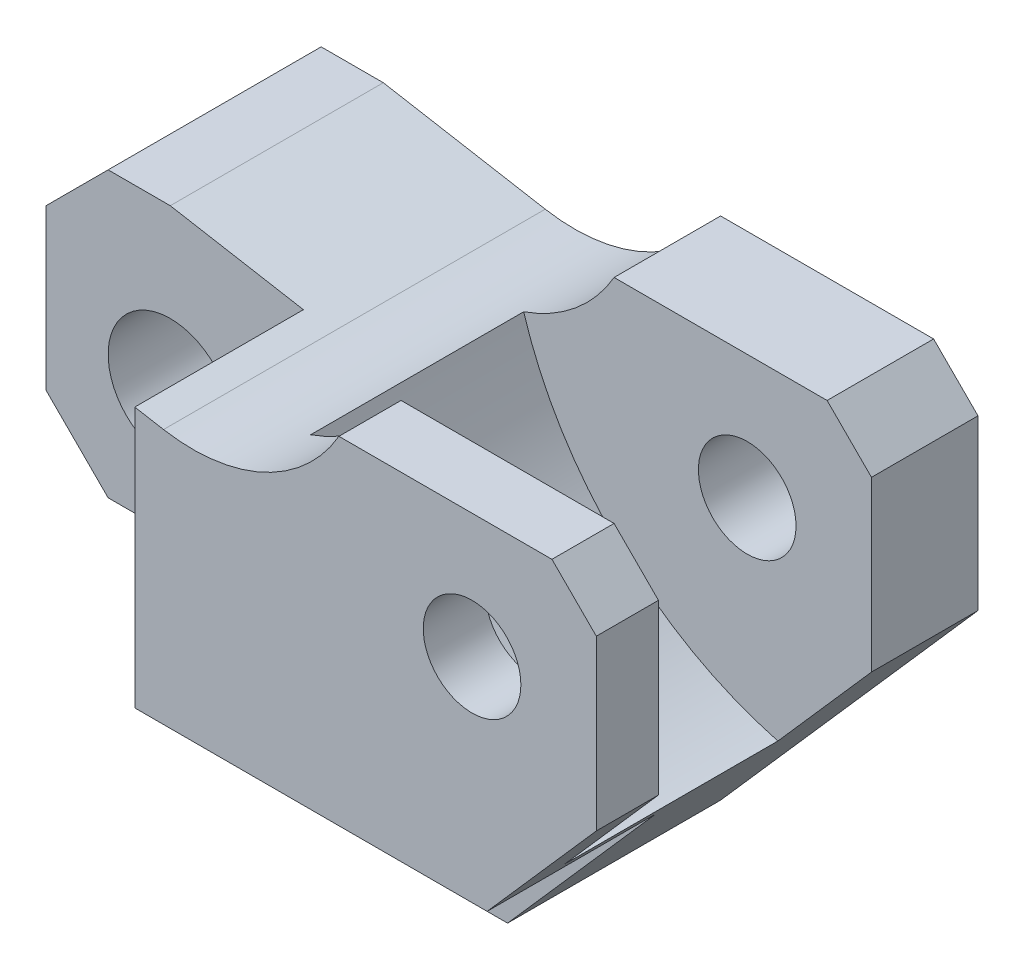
ISO-10303-21;
HEADER;
FILE_DESCRIPTION(('STEP AP214'),'2;1');
FILE_NAME('part.step','',(''),(''),'','','');
FILE_SCHEMA(('AUTOMOTIVE_DESIGN { 1 0 10303 214 1 1 1 1 }'));
ENDSEC;
DATA;
#1=APPLICATION_CONTEXT('core data for automotive mechanical design processes');
#2=APPLICATION_PROTOCOL_DEFINITION('international standard','automotive_design',2000,#1);
#3=PRODUCT_CONTEXT('',#1,'mechanical');
#4=PRODUCT('Part','Part','',(#3));
#5=PRODUCT_RELATED_PRODUCT_CATEGORY('part','',(#4));
#6=PRODUCT_DEFINITION_FORMATION('','',#4);
#7=PRODUCT_DEFINITION_CONTEXT('part definition',#1,'design');
#8=PRODUCT_DEFINITION('design','',#6,#7);
#9=PRODUCT_DEFINITION_SHAPE('','',#8);
#10=(LENGTH_UNIT() NAMED_UNIT(*) SI_UNIT(.MILLI.,.METRE.));
#11=(NAMED_UNIT(*) PLANE_ANGLE_UNIT() SI_UNIT($,.RADIAN.));
#12=(NAMED_UNIT(*) SI_UNIT($,.STERADIAN.) SOLID_ANGLE_UNIT());
#13=UNCERTAINTY_MEASURE_WITH_UNIT(LENGTH_MEASURE(1.E-05),#10,'distance_accuracy_value','');
#14=(GEOMETRIC_REPRESENTATION_CONTEXT(3) GLOBAL_UNCERTAINTY_ASSIGNED_CONTEXT((#13)) GLOBAL_UNIT_ASSIGNED_CONTEXT((#10,
#11,#12)) REPRESENTATION_CONTEXT('',''));
#15=CARTESIAN_POINT('',(0.,0.,0.));
#16=DIRECTION('',(0.,0.,1.));
#17=DIRECTION('',(1.,0.,0.));
#18=AXIS2_PLACEMENT_3D('',#15,#16,#17);
#19=CARTESIAN_POINT('',(67.,0.,43.));
#20=DIRECTION('',(-0.751164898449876,0.660114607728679,0.));
#21=DIRECTION('',(-0.660114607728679,-0.751164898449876,0.));
#22=AXIS2_PLACEMENT_3D('',#19,#20,#21);
#23=PLANE('',#22);
#24=DIRECTION('',(0.660114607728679,0.751164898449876,0.));
#25=VECTOR('',#24,1.);
#26=CARTESIAN_POINT('',(37.8046632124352,-33.2222797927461,12.));
#27=LINE('',#26,#25);
#28=CARTESIAN_POINT('',(56.4545454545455,-12.,12.));
#29=VERTEX_POINT('',#28);
#30=CARTESIAN_POINT('',(67.,0.,12.));
#31=VERTEX_POINT('',#30);
#32=EDGE_CURVE('E199',#29,#31,#27,.T.);
#33=ORIENTED_EDGE('',*,*,#32,.F.);
#34=DIRECTION('',(0.,0.,1.));
#35=VECTOR('',#34,1.);
#36=CARTESIAN_POINT('',(56.4545454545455,-12.,12.));
#37=LINE('',#36,#35);
#38=CARTESIAN_POINT('',(56.4545454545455,-12.,36.));
#39=VERTEX_POINT('',#38);
#40=EDGE_CURVE('E196',#29,#39,#37,.T.);
#41=ORIENTED_EDGE('',*,*,#40,.T.);
#42=DIRECTION('',(0.660114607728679,0.751164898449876,0.));
#43=VECTOR('',#42,1.);
#44=CARTESIAN_POINT('',(37.8046632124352,-33.2222797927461,36.));
#45=LINE('',#44,#43);
#46=CARTESIAN_POINT('',(67.,0.,36.));
#47=VERTEX_POINT('',#46);
#48=EDGE_CURVE('E445',#39,#47,#45,.T.);
#49=ORIENTED_EDGE('',*,*,#48,.T.);
#50=DIRECTION('',(0.,0.,-1.));
#51=VECTOR('',#50,1.);
#52=CARTESIAN_POINT('',(67.,0.,43.));
#53=LINE('',#52,#51);
#54=CARTESIAN_POINT('',(67.,0.,43.));
#55=VERTEX_POINT('',#54);
#56=EDGE_CURVE('E345',#55,#47,#53,.T.);
#57=ORIENTED_EDGE('',*,*,#56,.F.);
#58=DIRECTION('',(0.660114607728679,0.751164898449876,0.));
#59=VECTOR('',#58,1.);
#60=CARTESIAN_POINT('',(67.,0.,43.));
#61=LINE('',#60,#59);
#62=CARTESIAN_POINT('',(54.6969696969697,-14.,43.));
#63=VERTEX_POINT('',#62);
#64=EDGE_CURVE('E269',#63,#55,#61,.T.);
#65=ORIENTED_EDGE('',*,*,#64,.F.);
#66=DIRECTION('',(0.,0.,1.));
#67=VECTOR('',#66,1.);
#68=CARTESIAN_POINT('',(54.6969696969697,-14.,24.));
#69=LINE('',#68,#67);
#70=CARTESIAN_POINT('',(54.6969696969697,-14.,24.));
#71=VERTEX_POINT('',#70);
#72=EDGE_CURVE('E236',#71,#63,#69,.T.);
#73=ORIENTED_EDGE('',*,*,#72,.F.);
#74=DIRECTION('',(0.660114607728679,0.751164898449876,0.));
#75=VECTOR('',#74,1.);
#76=CARTESIAN_POINT('',(37.8046632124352,-33.2222797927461,24.));
#77=LINE('',#76,#75);
#78=CARTESIAN_POINT('',(38.,-33.,24.));
#79=VERTEX_POINT('',#78);
#80=EDGE_CURVE('E234',#79,#71,#77,.T.);
#81=ORIENTED_EDGE('',*,*,#80,.F.);
#82=DIRECTION('',(0.,0.,-1.));
#83=VECTOR('',#82,1.);
#84=CARTESIAN_POINT('',(38.,-33.,43.));
#85=LINE('',#84,#83);
#86=CARTESIAN_POINT('',(38.,-33.,0.));
#87=VERTEX_POINT('',#86);
#88=EDGE_CURVE('E348',#79,#87,#85,.T.);
#89=ORIENTED_EDGE('',*,*,#88,.T.);
#90=DIRECTION('',(0.660114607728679,0.751164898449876,0.));
#91=VECTOR('',#90,1.);
#92=CARTESIAN_POINT('',(67.,0.,0.));
#93=LINE('',#92,#91);
#94=CARTESIAN_POINT('',(67.,0.,0.));
#95=VERTEX_POINT('',#94);
#96=EDGE_CURVE('E298',#87,#95,#93,.T.);
#97=ORIENTED_EDGE('',*,*,#96,.T.);
#98=EDGE_CURVE('E344',#31,#95,#53,.T.);
#99=ORIENTED_EDGE('',*,*,#98,.F.);
#100=EDGE_LOOP('',(#33,#41,#49,#57,#65,#73,#81,#89,#97,#99));
#101=FACE_BOUND('',#100,.T.);
#102=ADVANCED_FACE('F35',(#101),#23,.F.);
#103=CARTESIAN_POINT('',(67.,19.,43.));
#104=DIRECTION('',(-1.,0.,0.));
#105=DIRECTION('',(0.,0.,1.));
#106=AXIS2_PLACEMENT_3D('',#103,#104,#105);
#107=PLANE('',#106);
#108=DIRECTION('',(0.,1.,0.));
#109=VECTOR('',#108,1.);
#110=CARTESIAN_POINT('',(67.,0.,12.));
#111=LINE('',#110,#109);
#112=CARTESIAN_POINT('',(67.,19.,12.));
#113=VERTEX_POINT('',#112);
#114=EDGE_CURVE('E435',#31,#113,#111,.T.);
#115=ORIENTED_EDGE('',*,*,#114,.F.);
#116=ORIENTED_EDGE('',*,*,#98,.T.);
#117=DIRECTION('',(0.,1.,0.));
#118=VECTOR('',#117,1.);
#119=CARTESIAN_POINT('',(67.,19.,0.));
#120=LINE('',#119,#118);
#121=CARTESIAN_POINT('',(67.,19.,0.));
#122=VERTEX_POINT('',#121);
#123=EDGE_CURVE('E301',#95,#122,#120,.T.);
#124=ORIENTED_EDGE('',*,*,#123,.T.);
#125=DIRECTION('',(0.,0.,-1.));
#126=VECTOR('',#125,1.);
#127=CARTESIAN_POINT('',(67.,19.,43.));
#128=LINE('',#127,#126);
#129=EDGE_CURVE('E340',#113,#122,#128,.T.);
#130=ORIENTED_EDGE('',*,*,#129,.F.);
#131=EDGE_LOOP('',(#115,#116,#124,#130));
#132=FACE_BOUND('',#131,.T.);
#133=ADVANCED_FACE('F434',(#132),#107,.F.);
#134=CARTESIAN_POINT('',(62.,24.,43.));
#135=DIRECTION('',(-0.707106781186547,-0.707106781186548,0.));
#136=DIRECTION('',(0.707106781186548,-0.707106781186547,0.));
#137=AXIS2_PLACEMENT_3D('',#134,#135,#136);
#138=PLANE('',#137);
#139=DIRECTION('',(-0.707106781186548,0.707106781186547,0.));
#140=VECTOR('',#139,1.);
#141=CARTESIAN_POINT('',(43.,43.,12.));
#142=LINE('',#141,#140);
#143=CARTESIAN_POINT('',(62.,24.,12.));
#144=VERTEX_POINT('',#143);
#145=EDGE_CURVE('E216',#113,#144,#142,.T.);
#146=ORIENTED_EDGE('',*,*,#145,.F.);
#147=ORIENTED_EDGE('',*,*,#129,.T.);
#148=DIRECTION('',(-0.707106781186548,0.707106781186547,0.));
#149=VECTOR('',#148,1.);
#150=CARTESIAN_POINT('',(62.,24.,0.));
#151=LINE('',#150,#149);
#152=CARTESIAN_POINT('',(62.,24.,0.));
#153=VERTEX_POINT('',#152);
#154=EDGE_CURVE('E304',#122,#153,#151,.T.);
#155=ORIENTED_EDGE('',*,*,#154,.T.);
#156=DIRECTION('',(0.,0.,-1.));
#157=VECTOR('',#156,1.);
#158=CARTESIAN_POINT('',(62.,24.,43.));
#159=LINE('',#158,#157);
#160=EDGE_CURVE('E336',#144,#153,#159,.T.);
#161=ORIENTED_EDGE('',*,*,#160,.F.);
#162=EDGE_LOOP('',(#146,#147,#155,#161));
#163=FACE_BOUND('',#162,.T.);
#164=ADVANCED_FACE('F430',(#163),#138,.F.);
#165=CARTESIAN_POINT('',(38.,24.,43.));
#166=DIRECTION('',(0.,-1.,0.));
#167=DIRECTION('',(0.,0.,-1.));
#168=AXIS2_PLACEMENT_3D('',#165,#166,#167);
#169=PLANE('',#168);
#170=DIRECTION('',(-1.,0.,0.));
#171=VECTOR('',#170,1.);
#172=CARTESIAN_POINT('',(0.,24.,12.));
#173=LINE('',#172,#171);
#174=CARTESIAN_POINT('',(38.,24.,12.));
#175=VERTEX_POINT('',#174);
#176=EDGE_CURVE('E205',#144,#175,#173,.T.);
#177=ORIENTED_EDGE('',*,*,#176,.F.);
#178=ORIENTED_EDGE('',*,*,#160,.T.);
#179=DIRECTION('',(-1.,0.,0.));
#180=VECTOR('',#179,1.);
#181=CARTESIAN_POINT('',(38.,24.,0.));
#182=LINE('',#181,#180);
#183=CARTESIAN_POINT('',(38.,24.,0.));
#184=VERTEX_POINT('',#183);
#185=EDGE_CURVE('E307',#153,#184,#182,.T.);
#186=ORIENTED_EDGE('',*,*,#185,.T.);
#187=DIRECTION('',(0.,0.,-1.));
#188=VECTOR('',#187,1.);
#189=CARTESIAN_POINT('',(38.,24.,43.));
#190=LINE('',#189,#188);
#191=EDGE_CURVE('E333',#175,#184,#190,.T.);
#192=ORIENTED_EDGE('',*,*,#191,.F.);
#193=EDGE_LOOP('',(#177,#178,#186,#192));
#194=FACE_BOUND('',#193,.T.);
#195=ADVANCED_FACE('F425',(#194),#169,.F.);
#196=CARTESIAN_POINT('',(21.5424003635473,33.4945992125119,43.));
#197=DIRECTION('',(0.,0.,-1.));
#198=DIRECTION('',(-1.,0.,0.));
#199=AXIS2_PLACEMENT_3D('',#196,#197,#198);
#200=CYLINDRICAL_SURFACE('',#199,19.);
#201=CARTESIAN_POINT('',(21.5424003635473,33.4945992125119,12.));
#202=DIRECTION('',(0.,0.,1.));
#203=DIRECTION('',(1.,0.,0.));
#204=AXIS2_PLACEMENT_3D('',#201,#202,#203);
#205=CIRCLE('',#204,19.);
#206=CARTESIAN_POINT('',(27.8141459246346,15.5595718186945,12.));
#207=VERTEX_POINT('',#206);
#208=EDGE_CURVE('E200',#175,#207,#205,.F.);
#209=ORIENTED_EDGE('',*,*,#208,.F.);
#210=ORIENTED_EDGE('',*,*,#191,.T.);
#211=CARTESIAN_POINT('',(21.5424003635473,33.4945992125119,0.));
#212=DIRECTION('',(0.,0.,-1.));
#213=DIRECTION('',(-1.,0.,0.));
#214=AXIS2_PLACEMENT_3D('',#211,#212,#213);
#215=CIRCLE('',#214,19.);
#216=CARTESIAN_POINT('',(18.2430849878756,14.78325190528,0.));
#217=VERTEX_POINT('',#216);
#218=EDGE_CURVE('E310',#184,#217,#215,.T.);
#219=ORIENTED_EDGE('',*,*,#218,.T.);
#220=DIRECTION('',(0.,0.,-1.));
#221=VECTOR('',#220,1.);
#222=CARTESIAN_POINT('',(18.2430849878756,14.78325190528,43.));
#223=LINE('',#222,#221);
#224=CARTESIAN_POINT('',(18.2430849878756,14.78325190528,43.));
#225=VERTEX_POINT('',#224);
#226=EDGE_CURVE('E330',#225,#217,#223,.T.);
#227=ORIENTED_EDGE('',*,*,#226,.F.);
#228=CARTESIAN_POINT('',(21.5424003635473,33.4945992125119,43.));
#229=DIRECTION('',(0.,0.,-1.));
#230=DIRECTION('',(-1.,0.,0.));
#231=AXIS2_PLACEMENT_3D('',#228,#229,#230);
#232=CIRCLE('',#231,19.);
#233=CARTESIAN_POINT('',(38.,24.,43.));
#234=VERTEX_POINT('',#233);
#235=EDGE_CURVE('E278',#234,#225,#232,.T.);
#236=ORIENTED_EDGE('',*,*,#235,.F.);
#237=CARTESIAN_POINT('',(38.,24.,36.));
#238=VERTEX_POINT('',#237);
#239=EDGE_CURVE('E334',#234,#238,#190,.T.);
#240=ORIENTED_EDGE('',*,*,#239,.T.);
#241=CARTESIAN_POINT('',(21.5424003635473,33.4945992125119,36.));
#242=DIRECTION('',(0.,0.,1.));
#243=DIRECTION('',(1.,0.,0.));
#244=AXIS2_PLACEMENT_3D('',#241,#242,#243);
#245=CIRCLE('',#244,19.);
#246=CARTESIAN_POINT('',(27.8141459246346,15.5595718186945,36.));
#247=VERTEX_POINT('',#246);
#248=EDGE_CURVE('E212',#238,#247,#245,.F.);
#249=ORIENTED_EDGE('',*,*,#248,.T.);
#250=DIRECTION('',(0.,0.,1.));
#251=VECTOR('',#250,1.);
#252=CARTESIAN_POINT('',(27.8141459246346,15.5595718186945,12.));
#253=LINE('',#252,#251);
#254=EDGE_CURVE('E193',#207,#247,#253,.T.);
#255=ORIENTED_EDGE('',*,*,#254,.F.);
#256=EDGE_LOOP('',(#209,#210,#219,#227,#236,#240,#249,#255));
#257=FACE_BOUND('',#256,.T.);
#258=ADVANCED_FACE('F210',(#257),#200,.F.);
#259=CARTESIAN_POINT('',(53.,10.,0.));
#260=DIRECTION('',(0.,0.,1.));
#261=DIRECTION('',(1.,0.,0.));
#262=AXIS2_PLACEMENT_3D('',#259,#260,#261);
#263=CYLINDRICAL_SURFACE('',#262,5.5);
#264=CARTESIAN_POINT('',(53.,10.,0.));
#265=DIRECTION('',(0.,0.,1.));
#266=DIRECTION('',(1.,0.,0.));
#267=AXIS2_PLACEMENT_3D('',#264,#265,#266);
#268=CIRCLE('',#267,5.5);
#269=CARTESIAN_POINT('',(58.5,10.,0.));
#270=VERTEX_POINT('',#269);
#271=EDGE_CURVE('E220',#270,#270,#268,.T.);
#272=ORIENTED_EDGE('',*,*,#271,.F.);
#273=EDGE_LOOP('',(#272));
#274=FACE_BOUND('',#273,.T.);
#275=CARTESIAN_POINT('',(53.,10.,12.));
#276=DIRECTION('',(0.,0.,1.));
#277=DIRECTION('',(1.,0.,0.));
#278=AXIS2_PLACEMENT_3D('',#275,#276,#277);
#279=CIRCLE('',#278,5.5);
#280=CARTESIAN_POINT('',(58.5,10.,12.));
#281=VERTEX_POINT('',#280);
#282=EDGE_CURVE('E208',#281,#281,#279,.T.);
#283=ORIENTED_EDGE('',*,*,#282,.T.);
#284=EDGE_LOOP('',(#283));
#285=FACE_BOUND('',#284,.T.);
#286=ADVANCED_FACE('F460',(#274,#285),#263,.F.);
#287=CARTESIAN_POINT('',(21.5424003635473,33.4945992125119,43.));
#288=DIRECTION('',(0.,0.,-1.));
#289=DIRECTION('',(-1.,0.,0.));
#290=AXIS2_PLACEMENT_3D('',#287,#288,#289);
#291=PLANE('',#290);
#292=CARTESIAN_POINT('',(53.,10.,43.));
#293=DIRECTION('',(0.,0.,1.));
#294=DIRECTION('',(1.,0.,0.));
#295=AXIS2_PLACEMENT_3D('',#292,#293,#294);
#296=CIRCLE('',#295,5.5);
#297=CARTESIAN_POINT('',(58.5,10.,43.));
#298=VERTEX_POINT('',#297);
#299=EDGE_CURVE('E214',#298,#298,#296,.T.);
#300=ORIENTED_EDGE('',*,*,#299,.F.);
#301=EDGE_LOOP('',(#300));
#302=FACE_BOUND('',#301,.T.);
#303=DIRECTION('',(1.,0.,0.));
#304=VECTOR('',#303,1.);
#305=CARTESIAN_POINT('',(21.0666262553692,-14.,43.));
#306=LINE('',#305,#304);
#307=CARTESIAN_POINT('',(15.,-14.,43.));
#308=VERTEX_POINT('',#307);
#309=EDGE_CURVE('E267',#308,#63,#306,.T.);
#310=ORIENTED_EDGE('',*,*,#309,.T.);
#311=ORIENTED_EDGE('',*,*,#64,.T.);
#312=DIRECTION('',(0.,1.,0.));
#313=VECTOR('',#312,1.);
#314=CARTESIAN_POINT('',(67.,19.,43.));
#315=LINE('',#314,#313);
#316=CARTESIAN_POINT('',(67.,19.,43.));
#317=VERTEX_POINT('',#316);
#318=EDGE_CURVE('E272',#55,#317,#315,.T.);
#319=ORIENTED_EDGE('',*,*,#318,.T.);
#320=DIRECTION('',(-0.707106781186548,0.707106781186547,0.));
#321=VECTOR('',#320,1.);
#322=CARTESIAN_POINT('',(62.,24.,43.));
#323=LINE('',#322,#321);
#324=CARTESIAN_POINT('',(62.,24.,43.));
#325=VERTEX_POINT('',#324);
#326=EDGE_CURVE('E274',#317,#325,#323,.T.);
#327=ORIENTED_EDGE('',*,*,#326,.T.);
#328=DIRECTION('',(-1.,0.,0.));
#329=VECTOR('',#328,1.);
#330=CARTESIAN_POINT('',(38.,24.,43.));
#331=LINE('',#330,#329);
#332=EDGE_CURVE('E276',#325,#234,#331,.T.);
#333=ORIENTED_EDGE('',*,*,#332,.T.);
#334=ORIENTED_EDGE('',*,*,#235,.T.);
#335=DIRECTION('',(-0.984807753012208,0.173648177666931,0.));
#336=VECTOR('',#335,1.);
#337=CARTESIAN_POINT('',(0.,18.,43.));
#338=LINE('',#337,#336);
#339=CARTESIAN_POINT('',(15.,15.355095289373,43.));
#340=VERTEX_POINT('',#339);
#341=EDGE_CURVE('E280',#225,#340,#338,.T.);
#342=ORIENTED_EDGE('',*,*,#341,.T.);
#343=DIRECTION('',(0.,1.,0.));
#344=VECTOR('',#343,1.);
#345=CARTESIAN_POINT('',(15.,0.,43.));
#346=LINE('',#345,#344);
#347=EDGE_CURVE('E223',#308,#340,#346,.T.);
#348=ORIENTED_EDGE('',*,*,#347,.F.);
#349=EDGE_LOOP('',(#310,#311,#319,#327,#333,#334,#342,#348));
#350=FACE_BOUND('',#349,.T.);
#351=ADVANCED_FACE('F390',(#302,#350),#291,.F.);
#352=CARTESIAN_POINT('',(-7.00000000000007,-14.,43.));
#353=DIRECTION('',(0.707106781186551,0.707106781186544,0.));
#354=DIRECTION('',(-0.707106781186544,0.707106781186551,0.));
#355=AXIS2_PLACEMENT_3D('',#352,#353,#354);
#356=PLANE('',#355);
#357=DIRECTION('',(0.707106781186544,-0.707106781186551,0.));
#358=VECTOR('',#357,1.);
#359=CARTESIAN_POINT('',(-10.5000000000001,-10.5,24.));
#360=LINE('',#359,#358);
#361=CARTESIAN_POINT('',(-14.,-7.,24.));
#362=VERTEX_POINT('',#361);
#363=CARTESIAN_POINT('',(-7.00000000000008,-14.,24.));
#364=VERTEX_POINT('',#363);
#365=EDGE_CURVE('E257',#362,#364,#360,.T.);
#366=ORIENTED_EDGE('',*,*,#365,.F.);
#367=DIRECTION('',(0.,0.,-1.));
#368=VECTOR('',#367,1.);
#369=CARTESIAN_POINT('',(-14.,-7.,43.));
#370=LINE('',#369,#368);
#371=CARTESIAN_POINT('',(-14.,-7.,0.));
#372=VERTEX_POINT('',#371);
#373=EDGE_CURVE('E283',#362,#372,#370,.T.);
#374=ORIENTED_EDGE('',*,*,#373,.T.);
#375=DIRECTION('',(0.707106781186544,-0.707106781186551,0.));
#376=VECTOR('',#375,1.);
#377=CARTESIAN_POINT('',(-7.00000000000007,-14.,0.));
#378=LINE('',#377,#376);
#379=CARTESIAN_POINT('',(-7.00000000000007,-14.,0.));
#380=VERTEX_POINT('',#379);
#381=EDGE_CURVE('E266',#372,#380,#378,.T.);
#382=ORIENTED_EDGE('',*,*,#381,.T.);
#383=DIRECTION('',(0.,0.,-1.));
#384=VECTOR('',#383,1.);
#385=CARTESIAN_POINT('',(-7.00000000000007,-14.,43.));
#386=LINE('',#385,#384);
#387=EDGE_CURVE('E11',#364,#380,#386,.T.);
#388=ORIENTED_EDGE('',*,*,#387,.F.);
#389=EDGE_LOOP('',(#366,#374,#382,#388));
#390=FACE_BOUND('',#389,.T.);
#391=ADVANCED_FACE('F37',(#390),#356,.F.);
#392=CARTESIAN_POINT('',(21.0666262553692,-19.,43.));
#393=DIRECTION('',(0.,0.,-1.));
#394=DIRECTION('',(-1.,0.,0.));
#395=AXIS2_PLACEMENT_3D('',#392,#393,#394);
#396=CYLINDRICAL_SURFACE('',#395,5.);
#397=CARTESIAN_POINT('',(21.0666262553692,-19.,24.));
#398=DIRECTION('',(0.,0.,1.));
#399=DIRECTION('',(1.,0.,0.));
#400=AXIS2_PLACEMENT_3D('',#397,#398,#399);
#401=CIRCLE('',#400,5.);
#402=CARTESIAN_POINT('',(21.0666262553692,-14.,24.));
#403=VERTEX_POINT('',#402);
#404=CARTESIAN_POINT('',(26.0122649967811,-18.2647058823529,24.));
#405=VERTEX_POINT('',#404);
#406=EDGE_CURVE('E228',#403,#405,#401,.F.);
#407=ORIENTED_EDGE('',*,*,#406,.F.);
#408=DIRECTION('',(0.,0.,-1.));
#409=VECTOR('',#408,1.);
#410=CARTESIAN_POINT('',(21.0666262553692,-14.,43.));
#411=LINE('',#410,#409);
#412=CARTESIAN_POINT('',(21.0666262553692,-14.,0.));
#413=VERTEX_POINT('',#412);
#414=EDGE_CURVE('E43',#403,#413,#411,.T.);
#415=ORIENTED_EDGE('',*,*,#414,.T.);
#416=CARTESIAN_POINT('',(21.0666262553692,-19.,0.));
#417=DIRECTION('',(0.,0.,-1.));
#418=DIRECTION('',(1.,0.,0.));
#419=AXIS2_PLACEMENT_3D('',#416,#417,#418);
#420=CIRCLE('',#419,5.);
#421=CARTESIAN_POINT('',(26.0122649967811,-18.2647058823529,0.));
#422=VERTEX_POINT('',#421);
#423=EDGE_CURVE('E289',#413,#422,#420,.T.);
#424=ORIENTED_EDGE('',*,*,#423,.T.);
#425=DIRECTION('',(0.,0.,-1.));
#426=VECTOR('',#425,1.);
#427=CARTESIAN_POINT('',(26.0122649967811,-18.2647058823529,43.));
#428=LINE('',#427,#426);
#429=EDGE_CURVE('E352',#405,#422,#428,.T.);
#430=ORIENTED_EDGE('',*,*,#429,.F.);
#431=EDGE_LOOP('',(#407,#415,#424,#430));
#432=FACE_BOUND('',#431,.T.);
#433=ADVANCED_FACE('F356',(#432),#396,.F.);
#434=CARTESIAN_POINT('',(54.6969696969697,-14.,43.));
#435=DIRECTION('',(0.,0.,-1.));
#436=DIRECTION('',(-1.,0.,0.));
#437=AXIS2_PLACEMENT_3D('',#434,#435,#436);
#438=CYLINDRICAL_SURFACE('',#437,29.);
#439=CARTESIAN_POINT('',(54.6969696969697,-14.,24.));
#440=DIRECTION('',(0.,0.,1.));
#441=DIRECTION('',(1.,0.,0.));
#442=AXIS2_PLACEMENT_3D('',#439,#440,#441);
#443=CIRCLE('',#442,29.);
#444=CARTESIAN_POINT('',(32.788067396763,-33.,24.));
#445=VERTEX_POINT('',#444);
#446=EDGE_CURVE('E231',#405,#445,#443,.T.);
#447=ORIENTED_EDGE('',*,*,#446,.F.);
#448=ORIENTED_EDGE('',*,*,#429,.T.);
#449=CARTESIAN_POINT('',(54.6969696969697,-14.,0.));
#450=DIRECTION('',(0.,0.,1.));
#451=DIRECTION('',(-1.,0.,0.));
#452=AXIS2_PLACEMENT_3D('',#449,#450,#451);
#453=CIRCLE('',#452,29.);
#454=CARTESIAN_POINT('',(32.788067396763,-33.,0.));
#455=VERTEX_POINT('',#454);
#456=EDGE_CURVE('E292',#422,#455,#453,.T.);
#457=ORIENTED_EDGE('',*,*,#456,.T.);
#458=DIRECTION('',(0.,0.,-1.));
#459=VECTOR('',#458,1.);
#460=CARTESIAN_POINT('',(32.788067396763,-33.,43.));
#461=LINE('',#460,#459);
#462=EDGE_CURVE('E350',#445,#455,#461,.T.);
#463=ORIENTED_EDGE('',*,*,#462,.F.);
#464=EDGE_LOOP('',(#447,#448,#457,#463));
#465=FACE_BOUND('',#464,.T.);
#466=ADVANCED_FACE('F375',(#465),#438,.T.);
#467=CARTESIAN_POINT('',(38.,-33.,43.));
#468=DIRECTION('',(0.,1.,0.));
#469=DIRECTION('',(-1.,0.,0.));
#470=AXIS2_PLACEMENT_3D('',#467,#468,#469);
#471=PLANE('',#470);
#472=DIRECTION('',(1.,0.,0.));
#473=VECTOR('',#472,1.);
#474=CARTESIAN_POINT('',(0.,-32.9999999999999,24.));
#475=LINE('',#474,#473);
#476=EDGE_CURVE('E58',#445,#79,#475,.T.);
#477=ORIENTED_EDGE('',*,*,#476,.F.);
#478=ORIENTED_EDGE('',*,*,#462,.T.);
#479=DIRECTION('',(1.,0.,0.));
#480=VECTOR('',#479,1.);
#481=CARTESIAN_POINT('',(38.,-33.,0.));
#482=LINE('',#481,#480);
#483=EDGE_CURVE('E295',#455,#87,#482,.T.);
#484=ORIENTED_EDGE('',*,*,#483,.T.);
#485=ORIENTED_EDGE('',*,*,#88,.F.);
#486=EDGE_LOOP('',(#477,#478,#484,#485));
#487=FACE_BOUND('',#486,.T.);
#488=ADVANCED_FACE('F379',(#487),#471,.F.);
#489=CARTESIAN_POINT('',(-6.99999999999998,18.,43.));
#490=DIRECTION('',(0.,-1.,0.));
#491=DIRECTION('',(0.,0.,-1.));
#492=AXIS2_PLACEMENT_3D('',#489,#490,#491);
#493=PLANE('',#492);
#494=DIRECTION('',(-1.,0.,0.));
#495=VECTOR('',#494,1.);
#496=CARTESIAN_POINT('',(0.,18.,24.));
#497=LINE('',#496,#495);
#498=CARTESIAN_POINT('',(0.,18.,24.));
#499=VERTEX_POINT('',#498);
#500=CARTESIAN_POINT('',(-6.99999999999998,18.,24.));
#501=VERTEX_POINT('',#500);
#502=EDGE_CURVE('E251',#499,#501,#497,.T.);
#503=ORIENTED_EDGE('',*,*,#502,.F.);
#504=DIRECTION('',(0.,0.,-1.));
#505=VECTOR('',#504,1.);
#506=CARTESIAN_POINT('',(0.,18.,43.));
#507=LINE('',#506,#505);
#508=CARTESIAN_POINT('',(0.,18.,0.));
#509=VERTEX_POINT('',#508);
#510=EDGE_CURVE('E328',#499,#509,#507,.T.);
#511=ORIENTED_EDGE('',*,*,#510,.T.);
#512=DIRECTION('',(-1.,0.,0.));
#513=VECTOR('',#512,1.);
#514=CARTESIAN_POINT('',(-6.99999999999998,18.,0.));
#515=LINE('',#514,#513);
#516=CARTESIAN_POINT('',(-6.99999999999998,18.,0.));
#517=VERTEX_POINT('',#516);
#518=EDGE_CURVE('E315',#509,#517,#515,.T.);
#519=ORIENTED_EDGE('',*,*,#518,.T.);
#520=DIRECTION('',(0.,0.,-1.));
#521=VECTOR('',#520,1.);
#522=CARTESIAN_POINT('',(-6.99999999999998,18.,43.));
#523=LINE('',#522,#521);
#524=EDGE_CURVE('E326',#501,#517,#523,.T.);
#525=ORIENTED_EDGE('',*,*,#524,.F.);
#526=EDGE_LOOP('',(#503,#511,#519,#525));
#527=FACE_BOUND('',#526,.T.);
#528=ADVANCED_FACE('F406',(#527),#493,.F.);
#529=CARTESIAN_POINT('',(-14.,11.,43.));
#530=DIRECTION('',(0.707106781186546,-0.707106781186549,0.));
#531=DIRECTION('',(0.707106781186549,0.707106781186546,0.));
#532=AXIS2_PLACEMENT_3D('',#529,#530,#531);
#533=PLANE('',#532);
#534=DIRECTION('',(-0.707106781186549,-0.707106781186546,0.));
#535=VECTOR('',#534,1.);
#536=CARTESIAN_POINT('',(-12.5,12.5,24.));
#537=LINE('',#536,#535);
#538=CARTESIAN_POINT('',(-14.,11.,24.));
#539=VERTEX_POINT('',#538);
#540=EDGE_CURVE('E253',#501,#539,#537,.T.);
#541=ORIENTED_EDGE('',*,*,#540,.F.);
#542=ORIENTED_EDGE('',*,*,#524,.T.);
#543=DIRECTION('',(-0.707106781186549,-0.707106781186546,0.));
#544=VECTOR('',#543,1.);
#545=CARTESIAN_POINT('',(-14.,11.,0.));
#546=LINE('',#545,#544);
#547=CARTESIAN_POINT('',(-14.,11.,0.));
#548=VERTEX_POINT('',#547);
#549=EDGE_CURVE('E318',#517,#548,#546,.T.);
#550=ORIENTED_EDGE('',*,*,#549,.T.);
#551=DIRECTION('',(0.,0.,-1.));
#552=VECTOR('',#551,1.);
#553=CARTESIAN_POINT('',(-14.,11.,43.));
#554=LINE('',#553,#552);
#555=EDGE_CURVE('E324',#539,#548,#554,.T.);
#556=ORIENTED_EDGE('',*,*,#555,.F.);
#557=EDGE_LOOP('',(#541,#542,#550,#556));
#558=FACE_BOUND('',#557,.T.);
#559=ADVANCED_FACE('F410',(#558),#533,.F.);
#560=CARTESIAN_POINT('',(-14.,-7.,43.));
#561=DIRECTION('',(1.,0.,0.));
#562=DIRECTION('',(0.,0.,-1.));
#563=AXIS2_PLACEMENT_3D('',#560,#561,#562);
#564=PLANE('',#563);
#565=DIRECTION('',(0.,-1.,0.));
#566=VECTOR('',#565,1.);
#567=CARTESIAN_POINT('',(-14.,0.,24.));
#568=LINE('',#567,#566);
#569=EDGE_CURVE('E255',#539,#362,#568,.T.);
#570=ORIENTED_EDGE('',*,*,#569,.F.);
#571=ORIENTED_EDGE('',*,*,#555,.T.);
#572=DIRECTION('',(0.,-1.,0.));
#573=VECTOR('',#572,1.);
#574=CARTESIAN_POINT('',(-14.,-7.,0.));
#575=LINE('',#574,#573);
#576=EDGE_CURVE('E270',#548,#372,#575,.T.);
#577=ORIENTED_EDGE('',*,*,#576,.T.);
#578=ORIENTED_EDGE('',*,*,#373,.F.);
#579=EDGE_LOOP('',(#570,#571,#577,#578));
#580=FACE_BOUND('',#579,.T.);
#581=ADVANCED_FACE('F417',(#580),#564,.F.);
#582=CARTESIAN_POINT('',(0.,0.,43.));
#583=DIRECTION('',(0.,0.,-1.));
#584=DIRECTION('',(-1.,0.,0.));
#585=AXIS2_PLACEMENT_3D('',#582,#583,#584);
#586=CYLINDRICAL_SURFACE('',#585,7.);
#587=CARTESIAN_POINT('',(0.,0.,0.));
#588=DIRECTION('',(0.,0.,1.));
#589=DIRECTION('',(1.,0.,0.));
#590=AXIS2_PLACEMENT_3D('',#587,#588,#589);
#591=CIRCLE('',#590,7.);
#592=CARTESIAN_POINT('',(7.,0.,0.));
#593=VERTEX_POINT('',#592);
#594=EDGE_CURVE('E239',#593,#593,#591,.T.);
#595=ORIENTED_EDGE('',*,*,#594,.F.);
#596=EDGE_LOOP('',(#595));
#597=FACE_BOUND('',#596,.T.);
#598=CARTESIAN_POINT('',(0.,0.,24.));
#599=DIRECTION('',(0.,0.,1.));
#600=DIRECTION('',(1.,0.,0.));
#601=AXIS2_PLACEMENT_3D('',#598,#599,#600);
#602=CIRCLE('',#601,7.);
#603=CARTESIAN_POINT('',(7.,0.,24.));
#604=VERTEX_POINT('',#603);
#605=EDGE_CURVE('E240',#604,#604,#602,.F.);
#606=ORIENTED_EDGE('',*,*,#605,.F.);
#607=EDGE_LOOP('',(#606));
#608=FACE_BOUND('',#607,.T.);
#609=ADVANCED_FACE('F494',(#597,#608),#586,.F.);
#610=CARTESIAN_POINT('',(21.5424003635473,33.4945992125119,0.));
#611=DIRECTION('',(0.,0.,-1.));
#612=DIRECTION('',(-1.,0.,0.));
#613=AXIS2_PLACEMENT_3D('',#610,#611,#612);
#614=PLANE('',#613);
#615=ORIENTED_EDGE('',*,*,#271,.T.);
#616=EDGE_LOOP('',(#615));
#617=FACE_BOUND('',#616,.T.);
#618=ORIENTED_EDGE('',*,*,#381,.F.);
#619=ORIENTED_EDGE('',*,*,#576,.F.);
#620=ORIENTED_EDGE('',*,*,#549,.F.);
#621=ORIENTED_EDGE('',*,*,#518,.F.);
#622=DIRECTION('',(-0.984807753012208,0.173648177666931,0.));
#623=VECTOR('',#622,1.);
#624=CARTESIAN_POINT('',(0.,18.,0.));
#625=LINE('',#624,#623);
#626=EDGE_CURVE('E312',#217,#509,#625,.T.);
#627=ORIENTED_EDGE('',*,*,#626,.F.);
#628=ORIENTED_EDGE('',*,*,#218,.F.);
#629=ORIENTED_EDGE('',*,*,#185,.F.);
#630=ORIENTED_EDGE('',*,*,#154,.F.);
#631=ORIENTED_EDGE('',*,*,#123,.F.);
#632=ORIENTED_EDGE('',*,*,#96,.F.);
#633=ORIENTED_EDGE('',*,*,#483,.F.);
#634=ORIENTED_EDGE('',*,*,#456,.F.);
#635=ORIENTED_EDGE('',*,*,#423,.F.);
#636=DIRECTION('',(1.,0.,0.));
#637=VECTOR('',#636,1.);
#638=CARTESIAN_POINT('',(21.0666262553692,-14.,0.));
#639=LINE('',#638,#637);
#640=EDGE_CURVE('E286',#380,#413,#639,.T.);
#641=ORIENTED_EDGE('',*,*,#640,.F.);
#642=EDGE_LOOP('',(#618,#619,#620,#621,#627,#628,#629,#630,#631,#632,#633,#634,#635,#641));
#643=FACE_BOUND('',#642,.T.);
#644=ORIENTED_EDGE('',*,*,#594,.T.);
#645=EDGE_LOOP('',(#644));
#646=FACE_BOUND('',#645,.T.);
#647=ADVANCED_FACE('F368',(#617,#643,#646),#614,.T.);
#648=CARTESIAN_POINT('',(21.0666262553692,-14.,43.));
#649=DIRECTION('',(0.,1.,0.));
#650=DIRECTION('',(-1.,0.,0.));
#651=AXIS2_PLACEMENT_3D('',#648,#649,#650);
#652=PLANE('',#651);
#653=ORIENTED_EDGE('',*,*,#309,.F.);
#654=DIRECTION('',(0.,0.,1.));
#655=VECTOR('',#654,1.);
#656=CARTESIAN_POINT('',(15.,-14.,24.));
#657=LINE('',#656,#655);
#658=CARTESIAN_POINT('',(15.,-14.,24.));
#659=VERTEX_POINT('',#658);
#660=EDGE_CURVE('E259',#659,#308,#657,.T.);
#661=ORIENTED_EDGE('',*,*,#660,.F.);
#662=DIRECTION('',(1.,0.,0.));
#663=VECTOR('',#662,1.);
#664=CARTESIAN_POINT('',(0.,-14.,24.));
#665=LINE('',#664,#663);
#666=EDGE_CURVE('E243',#364,#659,#665,.T.);
#667=ORIENTED_EDGE('',*,*,#666,.F.);
#668=ORIENTED_EDGE('',*,*,#387,.T.);
#669=ORIENTED_EDGE('',*,*,#640,.T.);
#670=ORIENTED_EDGE('',*,*,#414,.F.);
#671=DIRECTION('',(1.,0.,0.));
#672=VECTOR('',#671,1.);
#673=CARTESIAN_POINT('',(0.,-14.,24.));
#674=LINE('',#673,#672);
#675=EDGE_CURVE('E226',#403,#71,#674,.T.);
#676=ORIENTED_EDGE('',*,*,#675,.T.);
#677=ORIENTED_EDGE('',*,*,#72,.T.);
#678=EDGE_LOOP('',(#653,#661,#667,#668,#669,#670,#676,#677));
#679=FACE_BOUND('',#678,.T.);
#680=ADVANCED_FACE('F363',(#679),#652,.F.);
#681=ORIENTED_EDGE('',*,*,#56,.T.);
#682=DIRECTION('',(0.,1.,0.));
#683=VECTOR('',#682,1.);
#684=CARTESIAN_POINT('',(67.,0.,36.));
#685=LINE('',#684,#683);
#686=CARTESIAN_POINT('',(67.,19.,36.));
#687=VERTEX_POINT('',#686);
#688=EDGE_CURVE('E447',#47,#687,#685,.T.);
#689=ORIENTED_EDGE('',*,*,#688,.T.);
#690=EDGE_CURVE('E341',#317,#687,#128,.T.);
#691=ORIENTED_EDGE('',*,*,#690,.F.);
#692=ORIENTED_EDGE('',*,*,#318,.F.);
#693=EDGE_LOOP('',(#681,#689,#691,#692));
#694=FACE_BOUND('',#693,.T.);
#695=ADVANCED_FACE('F479',(#694),#107,.F.);
#696=ORIENTED_EDGE('',*,*,#690,.T.);
#697=DIRECTION('',(-0.707106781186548,0.707106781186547,0.));
#698=VECTOR('',#697,1.);
#699=CARTESIAN_POINT('',(43.,43.,36.));
#700=LINE('',#699,#698);
#701=CARTESIAN_POINT('',(62.,24.,36.));
#702=VERTEX_POINT('',#701);
#703=EDGE_CURVE('E450',#687,#702,#700,.T.);
#704=ORIENTED_EDGE('',*,*,#703,.T.);
#705=EDGE_CURVE('E337',#325,#702,#159,.T.);
#706=ORIENTED_EDGE('',*,*,#705,.F.);
#707=ORIENTED_EDGE('',*,*,#326,.F.);
#708=EDGE_LOOP('',(#696,#704,#706,#707));
#709=FACE_BOUND('',#708,.T.);
#710=ADVANCED_FACE('F492',(#709),#138,.F.);
#711=ORIENTED_EDGE('',*,*,#705,.T.);
#712=DIRECTION('',(-1.,0.,0.));
#713=VECTOR('',#712,1.);
#714=CARTESIAN_POINT('',(0.,24.,36.));
#715=LINE('',#714,#713);
#716=EDGE_CURVE('E452',#702,#238,#715,.T.);
#717=ORIENTED_EDGE('',*,*,#716,.T.);
#718=ORIENTED_EDGE('',*,*,#239,.F.);
#719=ORIENTED_EDGE('',*,*,#332,.F.);
#720=EDGE_LOOP('',(#711,#717,#718,#719));
#721=FACE_BOUND('',#720,.T.);
#722=ADVANCED_FACE('F512',(#721),#169,.F.);
#723=CARTESIAN_POINT('',(0.,18.,43.));
#724=DIRECTION('',(-0.173648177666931,-0.984807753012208,0.));
#725=DIRECTION('',(0.984807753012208,-0.173648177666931,0.));
#726=AXIS2_PLACEMENT_3D('',#723,#724,#725);
#727=PLANE('',#726);
#728=DIRECTION('',(-0.984807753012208,0.173648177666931,0.));
#729=VECTOR('',#728,1.);
#730=CARTESIAN_POINT('',(3.07818128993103,17.4572335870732,24.));
#731=LINE('',#730,#729);
#732=CARTESIAN_POINT('',(15.,15.355095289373,24.));
#733=VERTEX_POINT('',#732);
#734=EDGE_CURVE('E249',#733,#499,#731,.T.);
#735=ORIENTED_EDGE('',*,*,#734,.F.);
#736=DIRECTION('',(0.,0.,1.));
#737=VECTOR('',#736,1.);
#738=CARTESIAN_POINT('',(15.,15.355095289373,24.));
#739=LINE('',#738,#737);
#740=EDGE_CURVE('E229',#733,#340,#739,.T.);
#741=ORIENTED_EDGE('',*,*,#740,.T.);
#742=ORIENTED_EDGE('',*,*,#341,.F.);
#743=ORIENTED_EDGE('',*,*,#226,.T.);
#744=ORIENTED_EDGE('',*,*,#626,.T.);
#745=ORIENTED_EDGE('',*,*,#510,.F.);
#746=EDGE_LOOP('',(#735,#741,#742,#743,#744,#745));
#747=FACE_BOUND('',#746,.T.);
#748=ADVANCED_FACE('F398',(#747),#727,.F.);
#749=CARTESIAN_POINT('',(15.,0.,24.));
#750=DIRECTION('',(1.,0.,0.));
#751=DIRECTION('',(0.,0.,-1.));
#752=AXIS2_PLACEMENT_3D('',#749,#750,#751);
#753=PLANE('',#752);
#754=ORIENTED_EDGE('',*,*,#347,.T.);
#755=ORIENTED_EDGE('',*,*,#740,.F.);
#756=DIRECTION('',(0.,1.,0.));
#757=VECTOR('',#756,1.);
#758=CARTESIAN_POINT('',(15.,0.,24.));
#759=LINE('',#758,#757);
#760=EDGE_CURVE('E246',#659,#733,#759,.T.);
#761=ORIENTED_EDGE('',*,*,#760,.F.);
#762=ORIENTED_EDGE('',*,*,#660,.T.);
#763=EDGE_LOOP('',(#754,#755,#761,#762));
#764=FACE_BOUND('',#763,.T.);
#765=ADVANCED_FACE('F395',(#764),#753,.F.);
#766=CARTESIAN_POINT('',(0.,0.,24.));
#767=DIRECTION('',(0.,0.,1.));
#768=DIRECTION('',(1.,0.,0.));
#769=AXIS2_PLACEMENT_3D('',#766,#767,#768);
#770=PLANE('',#769);
#771=ORIENTED_EDGE('',*,*,#605,.T.);
#772=EDGE_LOOP('',(#771));
#773=FACE_BOUND('',#772,.T.);
#774=ORIENTED_EDGE('',*,*,#666,.T.);
#775=ORIENTED_EDGE('',*,*,#760,.T.);
#776=ORIENTED_EDGE('',*,*,#734,.T.);
#777=ORIENTED_EDGE('',*,*,#502,.T.);
#778=ORIENTED_EDGE('',*,*,#540,.T.);
#779=ORIENTED_EDGE('',*,*,#569,.T.);
#780=ORIENTED_EDGE('',*,*,#365,.T.);
#781=EDGE_LOOP('',(#774,#775,#776,#777,#778,#779,#780));
#782=FACE_BOUND('',#781,.T.);
#783=ADVANCED_FACE('F402',(#773,#782),#770,.T.);
#784=CARTESIAN_POINT('',(0.,0.,24.));
#785=DIRECTION('',(0.,0.,1.));
#786=DIRECTION('',(1.,0.,0.));
#787=AXIS2_PLACEMENT_3D('',#784,#785,#786);
#788=PLANE('',#787);
#789=ORIENTED_EDGE('',*,*,#675,.F.);
#790=ORIENTED_EDGE('',*,*,#406,.T.);
#791=ORIENTED_EDGE('',*,*,#446,.T.);
#792=ORIENTED_EDGE('',*,*,#476,.T.);
#793=ORIENTED_EDGE('',*,*,#80,.T.);
#794=EDGE_LOOP('',(#789,#790,#791,#792,#793));
#795=FACE_BOUND('',#794,.T.);
#796=ADVANCED_FACE('F376',(#795),#788,.T.);
#797=CARTESIAN_POINT('',(53.,10.,36.));
#798=DIRECTION('',(0.,0.,1.));
#799=DIRECTION('',(1.,0.,0.));
#800=AXIS2_PLACEMENT_3D('',#797,#798,#799);
#801=CIRCLE('',#800,5.5);
#802=CARTESIAN_POINT('',(58.5,10.,36.));
#803=VERTEX_POINT('',#802);
#804=EDGE_CURVE('E440',#803,#803,#801,.T.);
#805=ORIENTED_EDGE('',*,*,#804,.F.);
#806=EDGE_LOOP('',(#805));
#807=FACE_BOUND('',#806,.T.);
#808=ORIENTED_EDGE('',*,*,#299,.T.);
#809=EDGE_LOOP('',(#808));
#810=FACE_BOUND('',#809,.T.);
#811=ADVANCED_FACE('F471',(#807,#810),#263,.F.);
#812=CARTESIAN_POINT('',(67.,27.6206182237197,12.));
#813=DIRECTION('',(0.,0.,1.));
#814=DIRECTION('',(1.,0.,0.));
#815=AXIS2_PLACEMENT_3D('',#812,#813,#814);
#816=CYLINDRICAL_SURFACE('',#815,41.);
#817=CARTESIAN_POINT('',(67.,27.6206182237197,36.));
#818=DIRECTION('',(0.,0.,1.));
#819=DIRECTION('',(1.,0.,0.));
#820=AXIS2_PLACEMENT_3D('',#817,#818,#819);
#821=CIRCLE('',#820,41.);
#822=EDGE_CURVE('E50',#247,#39,#821,.T.);
#823=ORIENTED_EDGE('',*,*,#822,.T.);
#824=ORIENTED_EDGE('',*,*,#40,.F.);
#825=CARTESIAN_POINT('',(67.,27.6206182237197,12.));
#826=DIRECTION('',(0.,0.,1.));
#827=DIRECTION('',(1.,0.,0.));
#828=AXIS2_PLACEMENT_3D('',#825,#826,#827);
#829=CIRCLE('',#828,41.);
#830=EDGE_CURVE('E189',#207,#29,#829,.T.);
#831=ORIENTED_EDGE('',*,*,#830,.F.);
#832=ORIENTED_EDGE('',*,*,#254,.T.);
#833=EDGE_LOOP('',(#823,#824,#831,#832));
#834=FACE_BOUND('',#833,.T.);
#835=ADVANCED_FACE('F191',(#834),#816,.F.);
#836=CARTESIAN_POINT('',(0.,0.,12.));
#837=DIRECTION('',(0.,0.,1.));
#838=DIRECTION('',(1.,0.,0.));
#839=AXIS2_PLACEMENT_3D('',#836,#837,#838);
#840=PLANE('',#839);
#841=ORIENTED_EDGE('',*,*,#282,.F.);
#842=EDGE_LOOP('',(#841));
#843=FACE_BOUND('',#842,.T.);
#844=ORIENTED_EDGE('',*,*,#208,.T.);
#845=ORIENTED_EDGE('',*,*,#830,.T.);
#846=ORIENTED_EDGE('',*,*,#32,.T.);
#847=ORIENTED_EDGE('',*,*,#114,.T.);
#848=ORIENTED_EDGE('',*,*,#145,.T.);
#849=ORIENTED_EDGE('',*,*,#176,.T.);
#850=EDGE_LOOP('',(#844,#845,#846,#847,#848,#849));
#851=FACE_BOUND('',#850,.T.);
#852=ADVANCED_FACE('F203',(#843,#851),#840,.T.);
#853=CARTESIAN_POINT('',(0.,0.,36.));
#854=DIRECTION('',(0.,0.,1.));
#855=DIRECTION('',(1.,0.,0.));
#856=AXIS2_PLACEMENT_3D('',#853,#854,#855);
#857=PLANE('',#856);
#858=ORIENTED_EDGE('',*,*,#804,.T.);
#859=EDGE_LOOP('',(#858));
#860=FACE_BOUND('',#859,.T.);
#861=ORIENTED_EDGE('',*,*,#248,.F.);
#862=ORIENTED_EDGE('',*,*,#716,.F.);
#863=ORIENTED_EDGE('',*,*,#703,.F.);
#864=ORIENTED_EDGE('',*,*,#688,.F.);
#865=ORIENTED_EDGE('',*,*,#48,.F.);
#866=ORIENTED_EDGE('',*,*,#822,.F.);
#867=EDGE_LOOP('',(#861,#862,#863,#864,#865,#866));
#868=FACE_BOUND('',#867,.T.);
#869=ADVANCED_FACE('F463',(#860,#868),#857,.F.);
#870=CLOSED_SHELL('',(#102,#133,#164,#195,#258,#286,#351,#391,#433,#466,#488,#528,#559,#581,
#609,#647,#680,#695,#710,#722,#748,#765,#783,#796,#811,#835,#852,#869));
#871=MANIFOLD_SOLID_BREP('B2',#870);
#872=ADVANCED_BREP_SHAPE_REPRESENTATION('',(#18,#871),#14);
#873=SHAPE_DEFINITION_REPRESENTATION(#9,#872);
ENDSEC;
END-ISO-10303-21;
